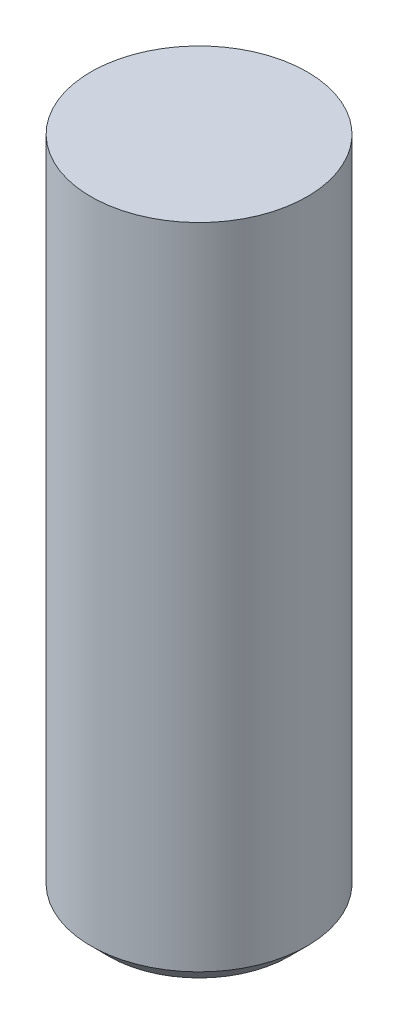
ISO-10303-21;
HEADER;
FILE_DESCRIPTION(('STEP AP214'),'2;1');
FILE_NAME('part.step','',(''),(''),'','','');
FILE_SCHEMA(('AUTOMOTIVE_DESIGN { 1 0 10303 214 1 1 1 1 }'));
ENDSEC;
DATA;
#1=APPLICATION_CONTEXT('core data for automotive mechanical design processes');
#2=APPLICATION_PROTOCOL_DEFINITION('international standard','automotive_design',2000,#1);
#3=PRODUCT_CONTEXT('',#1,'mechanical');
#4=PRODUCT('Part','Part','',(#3));
#5=PRODUCT_RELATED_PRODUCT_CATEGORY('part','',(#4));
#6=PRODUCT_DEFINITION_FORMATION('','',#4);
#7=PRODUCT_DEFINITION_CONTEXT('part definition',#1,'design');
#8=PRODUCT_DEFINITION('design','',#6,#7);
#9=PRODUCT_DEFINITION_SHAPE('','',#8);
#10=(LENGTH_UNIT() NAMED_UNIT(*) SI_UNIT(.MILLI.,.METRE.));
#11=(NAMED_UNIT(*) PLANE_ANGLE_UNIT() SI_UNIT($,.RADIAN.));
#12=(NAMED_UNIT(*) SI_UNIT($,.STERADIAN.) SOLID_ANGLE_UNIT());
#13=UNCERTAINTY_MEASURE_WITH_UNIT(LENGTH_MEASURE(1.E-05),#10,'distance_accuracy_value','');
#14=(GEOMETRIC_REPRESENTATION_CONTEXT(3) GLOBAL_UNCERTAINTY_ASSIGNED_CONTEXT((#13)) GLOBAL_UNIT_ASSIGNED_CONTEXT((#10,
#11,#12)) REPRESENTATION_CONTEXT('',''));
#15=CARTESIAN_POINT('',(0.,0.,0.));
#16=DIRECTION('',(0.,0.,1.));
#17=DIRECTION('',(1.,0.,0.));
#18=AXIS2_PLACEMENT_3D('',#15,#16,#17);
#19=CARTESIAN_POINT('',(0.,0.,0.));
#20=DIRECTION('',(0.,-1.,0.));
#21=DIRECTION('',(0.,0.,-1.));
#22=AXIS2_PLACEMENT_3D('',#19,#20,#21);
#23=CYLINDRICAL_SURFACE('',#22,6.);
#24=CARTESIAN_POINT('',(0.,0.,0.));
#25=DIRECTION('',(0.,-1.,0.));
#26=DIRECTION('',(0.,0.,-1.));
#27=AXIS2_PLACEMENT_3D('',#24,#25,#26);
#28=CIRCLE('',#27,6.);
#29=CARTESIAN_POINT('',(0.,0.,-6.));
#30=VERTEX_POINT('',#29);
#31=EDGE_CURVE('E10',#30,#30,#28,.T.);
#32=ORIENTED_EDGE('',*,*,#31,.T.);
#33=EDGE_LOOP('',(#32));
#34=FACE_BOUND('',#33,.T.);
#35=CARTESIAN_POINT('',(0.,-35.99999830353,0.));
#36=DIRECTION('',(0.,-1.,0.));
#37=DIRECTION('',(0.,0.,-1.));
#38=AXIS2_PLACEMENT_3D('',#35,#36,#37);
#39=CIRCLE('',#38,6.);
#40=CARTESIAN_POINT('',(0.,-35.99999830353,-6.));
#41=VERTEX_POINT('',#40);
#42=EDGE_CURVE('E43',#41,#41,#39,.T.);
#43=ORIENTED_EDGE('',*,*,#42,.F.);
#44=EDGE_LOOP('',(#43));
#45=FACE_BOUND('',#44,.T.);
#46=ADVANCED_FACE('F33',(#34,#45),#23,.T.);
#47=CARTESIAN_POINT('',(6.,0.,0.));
#48=DIRECTION('',(0.,1.,0.));
#49=DIRECTION('',(0.,0.,1.));
#50=AXIS2_PLACEMENT_3D('',#47,#48,#49);
#51=PLANE('',#50);
#52=ORIENTED_EDGE('',*,*,#31,.F.);
#53=EDGE_LOOP('',(#52));
#54=FACE_BOUND('',#53,.T.);
#55=ADVANCED_FACE('F54',(#54),#51,.T.);
#56=CARTESIAN_POINT('',(0.,-37.,0.));
#57=DIRECTION('',(0.,-1.,0.));
#58=DIRECTION('',(0.,0.,-1.));
#59=AXIS2_PLACEMENT_3D('',#56,#57,#58);
#60=PLANE('',#59);
#61=CARTESIAN_POINT('',(0.,-37.,0.));
#62=DIRECTION('',(0.,-1.,0.));
#63=DIRECTION('',(0.,0.,-1.));
#64=AXIS2_PLACEMENT_3D('',#61,#62,#63);
#65=CIRCLE('',#64,4.99999826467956);
#66=CARTESIAN_POINT('',(0.,-37.,-4.99999826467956));
#67=VERTEX_POINT('',#66);
#68=EDGE_CURVE('E39',#67,#67,#65,.T.);
#69=ORIENTED_EDGE('',*,*,#68,.T.);
#70=EDGE_LOOP('',(#69));
#71=FACE_BOUND('',#70,.T.);
#72=ADVANCED_FACE('F58',(#71),#60,.T.);
#73=CARTESIAN_POINT('',(0.,-37.,0.));
#74=DIRECTION('',(0.,1.,0.));
#75=DIRECTION('',(0.,0.,1.));
#76=AXIS2_PLACEMENT_3D('',#73,#74,#75);
#77=CONICAL_SURFACE('',#76,4.99999826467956,0.785398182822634);
#78=ORIENTED_EDGE('',*,*,#42,.T.);
#79=EDGE_LOOP('',(#78));
#80=FACE_BOUND('',#79,.T.);
#81=ORIENTED_EDGE('',*,*,#68,.F.);
#82=EDGE_LOOP('',(#81));
#83=FACE_BOUND('',#82,.T.);
#84=ADVANCED_FACE('F50',(#80,#83),#77,.T.);
#85=CLOSED_SHELL('',(#46,#55,#72,#84));
#86=MANIFOLD_SOLID_BREP('B2',#85);
#87=ADVANCED_BREP_SHAPE_REPRESENTATION('',(#18,#86),#14);
#88=SHAPE_DEFINITION_REPRESENTATION(#9,#87);
ENDSEC;
END-ISO-10303-21;
